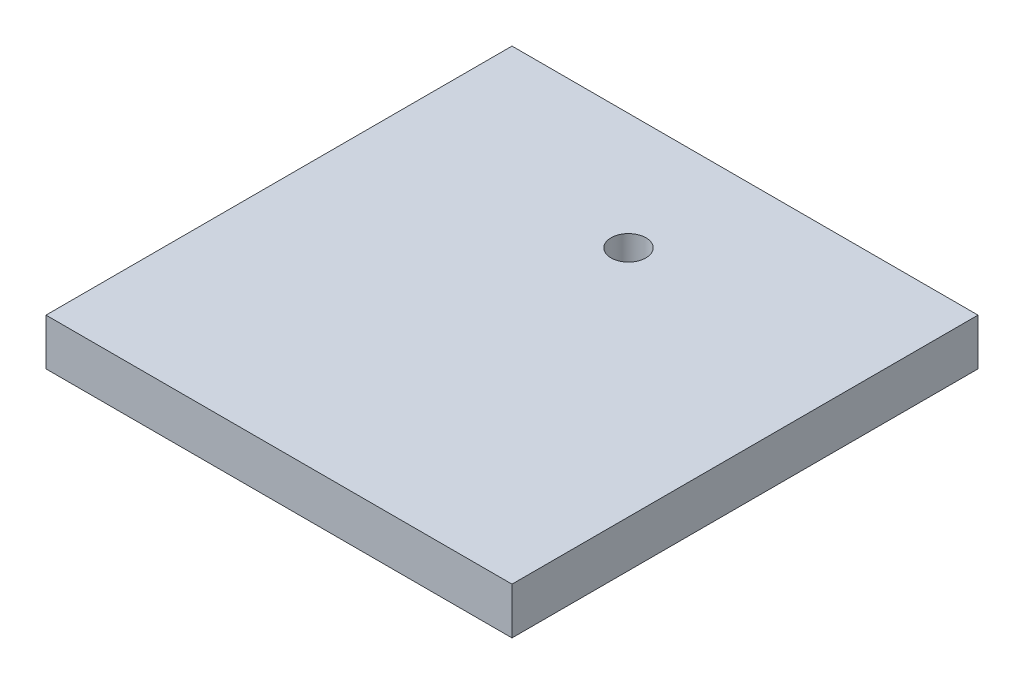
from build123d import *

# Parameters (mm, degrees)
SKETCH1_W                      = 100
SKETCH1_H                      = 100
EXTRUDE1_DEPTH                 = 10
F_7_5_7_5_DIAMETER_HOLE2_D     = 7.5
F_7_5_7_5_DIAMETER_HOLE2_DEPTH = 8
F_7_5_7_5_DIAMETER_HOLE2_TIP   = 2.253227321


with BuildPart() as part:
    # Sketch1 → Extrude1 (new body)
    with BuildSketch(Plane(origin=(0, 0, 0), x_dir=(1, 0, 0), z_dir=(0, 1, 0))):
        with Locations((50, 50)):
            Rectangle(SKETCH1_W, SKETCH1_H)
    extrude(amount=EXTRUDE1_DEPTH)

    # 7.5 _7.5_ Diameter Hole2
    with Locations(Plane(origin=(50, 10, -75), x_dir=(0, 0, 1), z_dir=(0, 1, 0))):
        with Locations((0, 0)):
            Hole(F_7_5_7_5_DIAMETER_HOLE2_D / 2, depth=F_7_5_7_5_DIAMETER_HOLE2_DEPTH)
            with Locations((0, 0, -(F_7_5_7_5_DIAMETER_HOLE2_DEPTH + F_7_5_7_5_DIAMETER_HOLE2_TIP / 2))):  # 118° drill point
                Cone(0, F_7_5_7_5_DIAMETER_HOLE2_D / 2, F_7_5_7_5_DIAMETER_HOLE2_TIP, mode=Mode.SUBTRACT)


solid = part.part
